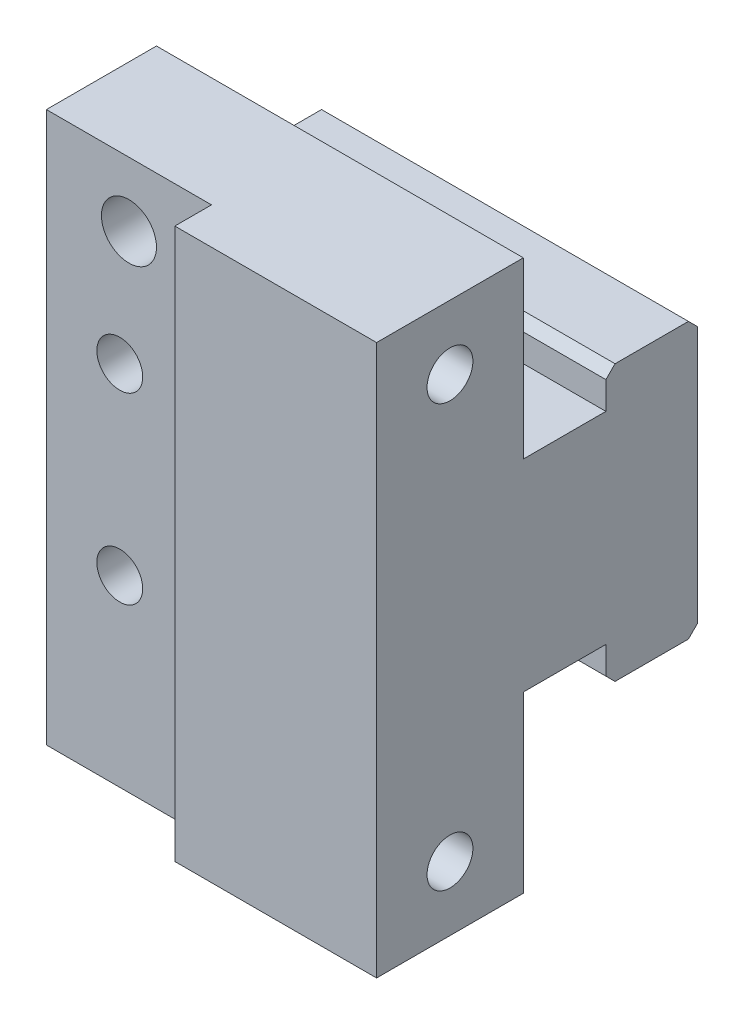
from build123d import *

# Parameters (mm, degrees)
EXTRUDE_1_DEPTH       = 20
SKETCH_2_W            = 9
SKETCH_2_H            = 30
CUT_EXTRUDE_1_DEPTH   = 2
M3X0_5_1_D            = 2.5
M3X0_5_1_DEPTH        = 7.5
M3X0_5_1_TIP          = 0.751075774
M3X0_5_2_D            = 2.5
M3X0_5_2_DEPTH        = 7.5
M3X0_5_2_TIP          = 0.751075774
CHAMFER_1_SIZE        = 0.5
HOLE_WIZARD_3_0_3_1_D = 3


with BuildPart() as part:
    # Sketch 1 → Extrude 1 (new body)
    with BuildSketch(Plane(origin=(0, 0, 0), x_dir=(0, 0, -1), z_dir=(1, 0, 0))):
        Polygon((0, 0), (8, 0), (8, -9.5), (12.5, -9.5), (12.5, -7.5), (17.5, -7.5), (17.5, -22.5), (12.5, -22.5), (12.5, -20.5), (8, -20.5), (8, -30), (0, -30), align=None)
    extrude(amount=EXTRUDE_1_DEPTH)

    # Sketch 2 → Cut-Extrude 1 (cut)
    with BuildSketch(Plane.XY):
        with Locations((4.5, -15)):
            Rectangle(SKETCH_2_W, SKETCH_2_H)
    extrude(amount=-CUT_EXTRUDE_1_DEPTH, mode=Mode.SUBTRACT)

    # M3x0.5 _1
    with Locations(Plane.XY.offset(-2)):
        with Locations((4, -10), (4, -20)):
            Hole(M3X0_5_1_D / 2, depth=M3X0_5_1_DEPTH)
            with Locations((0, 0, -(M3X0_5_1_DEPTH + M3X0_5_1_TIP / 2))):  # 118° drill point
                Cone(0, M3X0_5_1_D / 2, M3X0_5_1_TIP, mode=Mode.SUBTRACT)

    # M3x0.5 _2
    with Locations(Plane(origin=(20, 0, 0), x_dir=(0, 0, -1), z_dir=(1, 0, 0))):
        with Locations((4, -3.5), (4, -26.5)):
            Hole(M3X0_5_2_D / 2, depth=M3X0_5_2_DEPTH)
            with Locations((0, 0, -(M3X0_5_2_DEPTH + M3X0_5_2_TIP / 2))):  # 118° drill point
                Cone(0, M3X0_5_2_D / 2, M3X0_5_2_TIP, mode=Mode.SUBTRACT)

    # Chamfer 1
    chamfer_1_edges = [part.edges().sort_by_distance(p)[0] for p in [
        (10, -7.5, -12.5),
        (10, -7.5, -17.5),
        (10, -22.5, -17.5),
        (10, -22.5, -12.5),
    ]]
    chamfer(chamfer_1_edges, length=CHAMFER_1_SIZE)

    # Hole Wizard 3.0 _3_ _1 (through all)
    with Locations(Plane.XY.offset(-2)):
        with Locations((4.5, -3.5)):
            Hole(HOLE_WIZARD_3_0_3_1_D / 2)


solid = part.part
